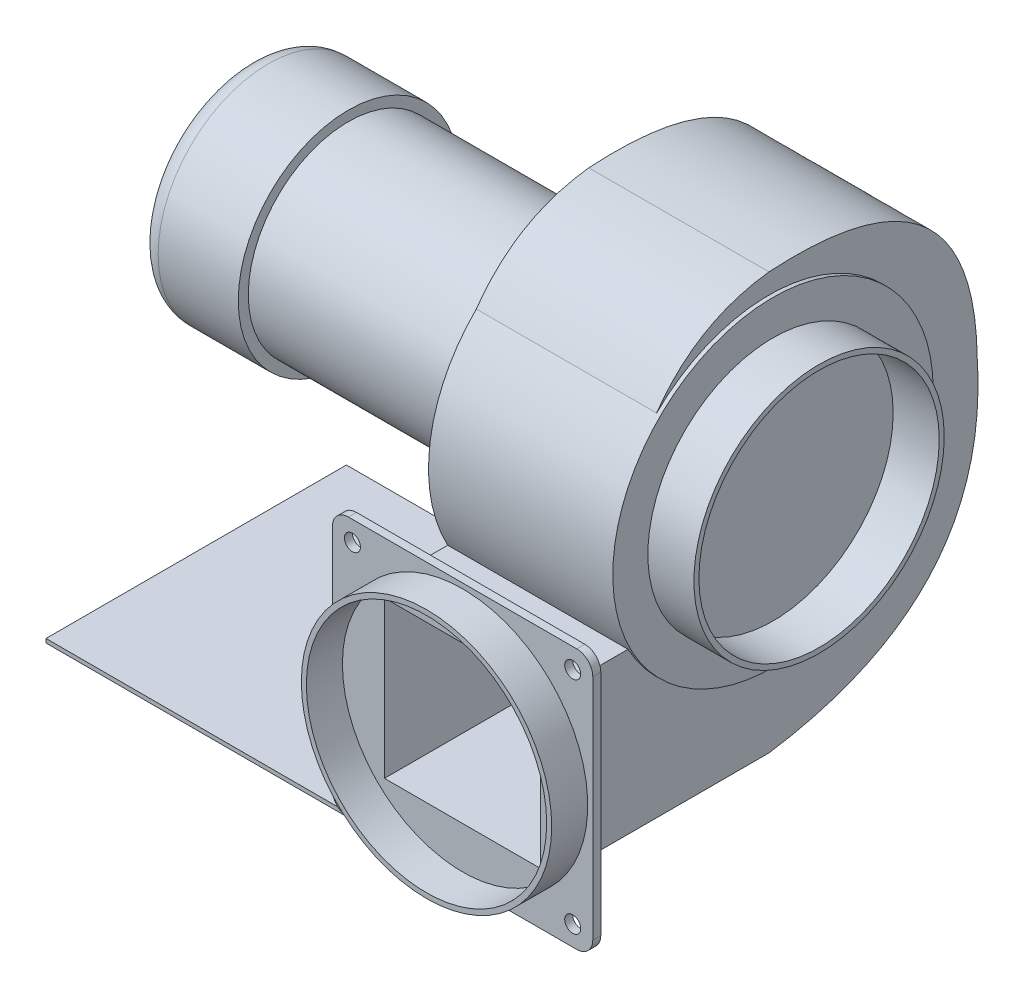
ISO-10303-21;
HEADER;
FILE_DESCRIPTION(('STEP AP214'),'2;1');
FILE_NAME('part.step','',(''),(''),'','','');
FILE_SCHEMA(('AUTOMOTIVE_DESIGN { 1 0 10303 214 1 1 1 1 }'));
ENDSEC;
DATA;
#1=APPLICATION_CONTEXT('core data for automotive mechanical design processes');
#2=APPLICATION_PROTOCOL_DEFINITION('international standard','automotive_design',2000,#1);
#3=PRODUCT_CONTEXT('',#1,'mechanical');
#4=PRODUCT('Part','Part','',(#3));
#5=PRODUCT_RELATED_PRODUCT_CATEGORY('part','',(#4));
#6=PRODUCT_DEFINITION_FORMATION('','',#4);
#7=PRODUCT_DEFINITION_CONTEXT('part definition',#1,'design');
#8=PRODUCT_DEFINITION('design','',#6,#7);
#9=PRODUCT_DEFINITION_SHAPE('','',#8);
#10=(LENGTH_UNIT() NAMED_UNIT(*) SI_UNIT(.MILLI.,.METRE.));
#11=(NAMED_UNIT(*) PLANE_ANGLE_UNIT() SI_UNIT($,.RADIAN.));
#12=(NAMED_UNIT(*) SI_UNIT($,.STERADIAN.) SOLID_ANGLE_UNIT());
#13=UNCERTAINTY_MEASURE_WITH_UNIT(LENGTH_MEASURE(1.E-05),#10,'distance_accuracy_value','');
#14=(GEOMETRIC_REPRESENTATION_CONTEXT(3) GLOBAL_UNCERTAINTY_ASSIGNED_CONTEXT((#13)) GLOBAL_UNIT_ASSIGNED_CONTEXT((#10,
#11,#12)) REPRESENTATION_CONTEXT('',''));
#15=CARTESIAN_POINT('',(0.,0.,0.));
#16=DIRECTION('',(0.,0.,1.));
#17=DIRECTION('',(1.,0.,0.));
#18=AXIS2_PLACEMENT_3D('',#15,#16,#17);
#19=CARTESIAN_POINT('',(-2.,0.,0.));
#20=DIRECTION('',(1.,0.,0.));
#21=DIRECTION('',(0.,0.,-1.));
#22=AXIS2_PLACEMENT_3D('',#19,#20,#21);
#23=PLANE('',#22);
#24=DIRECTION('',(0.,0.,-1.));
#25=VECTOR('',#24,1.);
#26=CARTESIAN_POINT('',(-2.,-145.,-46.));
#27=LINE('',#26,#25);
#28=CARTESIAN_POINT('',(-2.,-145.,104.));
#29=VERTEX_POINT('',#28);
#30=CARTESIAN_POINT('',(-2.,-145.,-46.));
#31=VERTEX_POINT('',#30);
#32=EDGE_CURVE('E49',#29,#31,#27,.T.);
#33=ORIENTED_EDGE('',*,*,#32,.F.);
#34=DIRECTION('',(0.,1.,0.));
#35=VECTOR('',#34,1.);
#36=CARTESIAN_POINT('',(-2.,-147.,104.));
#37=LINE('',#36,#35);
#38=CARTESIAN_POINT('',(-2.,-143.,104.));
#39=VERTEX_POINT('',#38);
#40=EDGE_CURVE('E253',#29,#39,#37,.T.);
#41=ORIENTED_EDGE('',*,*,#40,.T.);
#42=CARTESIAN_POINT('',(-2.,-67.,104.));
#43=VERTEX_POINT('',#42);
#44=EDGE_CURVE('E252',#39,#43,#37,.T.);
#45=ORIENTED_EDGE('',*,*,#44,.T.);
#46=DIRECTION('',(0.,0.,-1.));
#47=VECTOR('',#46,1.);
#48=CARTESIAN_POINT('',(-2.,-67.,104.));
#49=LINE('',#48,#47);
#50=CARTESIAN_POINT('',(-2.,-67.,-46.));
#51=VERTEX_POINT('',#50);
#52=EDGE_CURVE('E247',#43,#51,#49,.T.);
#53=ORIENTED_EDGE('',*,*,#52,.T.);
#54=DIRECTION('',(0.,-1.,0.));
#55=VECTOR('',#54,1.);
#56=CARTESIAN_POINT('',(-2.,-147.,-46.));
#57=LINE('',#56,#55);
#58=EDGE_CURVE('E250',#51,#31,#57,.T.);
#59=ORIENTED_EDGE('',*,*,#58,.T.);
#60=EDGE_LOOP('',(#33,#41,#45,#53,#59));
#61=FACE_BOUND('',#60,.T.);
#62=ADVANCED_FACE('F34',(#61),#23,.F.);
#63=CARTESIAN_POINT('',(0.,79.570920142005,32.1623547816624));
#64=DIRECTION('',(-1.,0.,0.));
#65=DIRECTION('',(0.,0.,1.));
#66=AXIS2_PLACEMENT_3D('',#63,#64,#65);
#67=PLANE('',#66);
#68=CARTESIAN_POINT('',(0.,0.,0.));
#69=DIRECTION('',(-1.,0.,0.));
#70=DIRECTION('',(0.,0.,1.));
#71=AXIS2_PLACEMENT_3D('',#68,#69,#70);
#72=CIRCLE('',#71,50.);
#73=CARTESIAN_POINT('',(0.,0.,50.));
#74=VERTEX_POINT('',#73);
#75=EDGE_CURVE('E270',#74,#74,#72,.T.);
#76=ORIENTED_EDGE('',*,*,#75,.F.);
#77=EDGE_LOOP('',(#76));
#78=FACE_BOUND('',#77,.T.);
#79=DIRECTION('',(0.,-1.,0.));
#80=VECTOR('',#79,1.);
#81=CARTESIAN_POINT('',(0.,-147.,-46.));
#82=LINE('',#81,#80);
#83=CARTESIAN_POINT('',(0.,-67.,-46.));
#84=VERTEX_POINT('',#83);
#85=CARTESIAN_POINT('',(0.,-105.381645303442,-46.));
#86=VERTEX_POINT('',#85);
#87=EDGE_CURVE('E258',#84,#86,#82,.T.);
#88=ORIENTED_EDGE('',*,*,#87,.F.);
#89=DIRECTION('',(0.,0.,-1.));
#90=VECTOR('',#89,1.);
#91=CARTESIAN_POINT('',(0.,-67.,104.));
#92=LINE('',#91,#90);
#93=CARTESIAN_POINT('',(0.,-67.,104.));
#94=VERTEX_POINT('',#93);
#95=EDGE_CURVE('E246',#94,#84,#92,.T.);
#96=ORIENTED_EDGE('',*,*,#95,.F.);
#97=DIRECTION('',(0.,-1.,0.));
#98=VECTOR('',#97,1.);
#99=CARTESIAN_POINT('',(0.,-118.,104.));
#100=LINE('',#99,#98);
#101=CARTESIAN_POINT('',(0.,-38.,104.));
#102=VERTEX_POINT('',#101);
#103=EDGE_CURVE('E480',#102,#94,#100,.T.);
#104=ORIENTED_EDGE('',*,*,#103,.F.);
#105=DIRECTION('',(0.,0.,1.));
#106=VECTOR('',#105,1.);
#107=CARTESIAN_POINT('',(0.,-38.,104.));
#108=LINE('',#107,#106);
#109=CARTESIAN_POINT('',(0.,-38.,70.3988636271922));
#110=VERTEX_POINT('',#109);
#111=EDGE_CURVE('E478',#110,#102,#108,.T.);
#112=ORIENTED_EDGE('',*,*,#111,.F.);
#113=CARTESIAN_POINT('',(0.,0.,0.));
#114=DIRECTION('',(1.,0.,0.));
#115=DIRECTION('',(0.,0.,-1.));
#116=AXIS2_PLACEMENT_3D('',#113,#114,#115);
#117=CIRCLE('',#116,80.);
#118=CARTESIAN_POINT('',(0.,57.,56.1337688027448));
#119=VERTEX_POINT('',#118);
#120=EDGE_CURVE('E473',#119,#110,#117,.T.);
#121=ORIENTED_EDGE('',*,*,#120,.F.);
#122=CARTESIAN_POINT('',(0.,90.,0.));
#123=CARTESIAN_POINT('',(0.,85.6418402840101,36.2578251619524));
#124=CARTESIAN_POINT('',(0.,57.,56.1337688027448));
#125=B_SPLINE_CURVE_WITH_KNOTS('',2,(#122,#123,#124),.UNSPECIFIED.,.F.,.F.,(3,3),(0.,1.),.UNSPECIFIED.);
#126=CARTESIAN_POINT('',(0.,90.,0.));
#127=VERTEX_POINT('',#126);
#128=EDGE_CURVE('E414',#127,#119,#125,.T.);
#129=ORIENTED_EDGE('',*,*,#128,.F.);
#130=CARTESIAN_POINT('',(0.,0.,-104.));
#131=CARTESIAN_POINT('',(0.,96.6691646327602,-102.835326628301));
#132=CARTESIAN_POINT('',(0.,90.,0.));
#133=B_SPLINE_CURVE_WITH_KNOTS('',2,(#130,#131,#132),.UNSPECIFIED.,.F.,.F.,(3,3),(0.,1.),.UNSPECIFIED.);
#134=CARTESIAN_POINT('',(0.,0.,-104.));
#135=VERTEX_POINT('',#134);
#136=EDGE_CURVE('E421',#135,#127,#133,.T.);
#137=ORIENTED_EDGE('',*,*,#136,.F.);
#138=CARTESIAN_POINT('',(0.,-118.,0.));
#139=CARTESIAN_POINT('',(0.,-101.631271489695,-110.598151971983));
#140=CARTESIAN_POINT('',(0.,0.,-104.));
#141=B_SPLINE_CURVE_WITH_KNOTS('',2,(#138,#139,#140),.UNSPECIFIED.,.F.,.F.,(3,3),(0.,1.),.UNSPECIFIED.);
#142=EDGE_CURVE('E486',#86,#135,#141,.T.);
#143=ORIENTED_EDGE('',*,*,#142,.F.);
#144=EDGE_LOOP('',(#88,#96,#104,#112,#121,#129,#137,#143));
#145=FACE_BOUND('',#144,.T.);
#146=ADVANCED_FACE('F548',(#78,#145),#67,.T.);
#147=CARTESIAN_POINT('',(102.,-21.,104.));
#148=DIRECTION('',(0.,0.,-1.));
#149=DIRECTION('',(-1.,0.,0.));
#150=AXIS2_PLACEMENT_3D('',#147,#148,#149);
#151=PLANE('',#150);
#152=CARTESIAN_POINT('',(-9.99999999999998,-23.,104.));
#153=DIRECTION('',(0.,0.,1.));
#154=DIRECTION('',(1.,0.,0.));
#155=AXIS2_PLACEMENT_3D('',#152,#153,#154);
#156=CIRCLE('',#155,4.);
#157=CARTESIAN_POINT('',(-5.99999999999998,-23.,104.));
#158=VERTEX_POINT('',#157);
#159=EDGE_CURVE('E339',#158,#158,#156,.T.);
#160=ORIENTED_EDGE('',*,*,#159,.T.);
#161=EDGE_LOOP('',(#160));
#162=FACE_BOUND('',#161,.T.);
#163=CARTESIAN_POINT('',(100.,-23.,104.));
#164=DIRECTION('',(0.,0.,1.));
#165=DIRECTION('',(1.,0.,0.));
#166=AXIS2_PLACEMENT_3D('',#163,#164,#165);
#167=CIRCLE('',#166,4.00000000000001);
#168=CARTESIAN_POINT('',(104.,-23.,104.));
#169=VERTEX_POINT('',#168);
#170=EDGE_CURVE('E333',#169,#169,#167,.T.);
#171=ORIENTED_EDGE('',*,*,#170,.T.);
#172=EDGE_LOOP('',(#171));
#173=FACE_BOUND('',#172,.T.);
#174=CARTESIAN_POINT('',(100.,-133.,104.));
#175=DIRECTION('',(0.,0.,1.));
#176=DIRECTION('',(1.,0.,0.));
#177=AXIS2_PLACEMENT_3D('',#174,#175,#176);
#178=CIRCLE('',#177,4.00000000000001);
#179=CARTESIAN_POINT('',(104.,-133.,104.));
#180=VERTEX_POINT('',#179);
#181=EDGE_CURVE('E327',#180,#180,#178,.T.);
#182=ORIENTED_EDGE('',*,*,#181,.T.);
#183=EDGE_LOOP('',(#182));
#184=FACE_BOUND('',#183,.T.);
#185=CARTESIAN_POINT('',(-9.99999999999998,-133.,104.));
#186=DIRECTION('',(0.,0.,1.));
#187=DIRECTION('',(1.,0.,0.));
#188=AXIS2_PLACEMENT_3D('',#185,#186,#187);
#189=CIRCLE('',#188,4.);
#190=CARTESIAN_POINT('',(-5.99999999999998,-133.,104.));
#191=VERTEX_POINT('',#190);
#192=EDGE_CURVE('E321',#191,#191,#189,.T.);
#193=ORIENTED_EDGE('',*,*,#192,.T.);
#194=EDGE_LOOP('',(#193));
#195=FACE_BOUND('',#194,.T.);
#196=ORIENTED_EDGE('',*,*,#103,.T.);
#197=DIRECTION('',(1.,0.,0.));
#198=VECTOR('',#197,1.);
#199=CARTESIAN_POINT('',(-2.,-67.,104.));
#200=LINE('',#199,#198);
#201=EDGE_CURVE('E255',#43,#94,#200,.T.);
#202=ORIENTED_EDGE('',*,*,#201,.F.);
#203=ORIENTED_EDGE('',*,*,#44,.F.);
#204=DIRECTION('',(1.,0.,0.));
#205=VECTOR('',#204,1.);
#206=CARTESIAN_POINT('',(-11.9999999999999,-143.,104.));
#207=LINE('',#206,#205);
#208=CARTESIAN_POINT('',(-11.9999999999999,-143.,104.));
#209=VERTEX_POINT('',#208);
#210=EDGE_CURVE('E384',#209,#39,#207,.T.);
#211=ORIENTED_EDGE('',*,*,#210,.F.);
#212=CARTESIAN_POINT('',(-12.,-135.,104.));
#213=DIRECTION('',(0.,0.,1.));
#214=DIRECTION('',(-1.,0.,0.));
#215=AXIS2_PLACEMENT_3D('',#212,#213,#214);
#216=CIRCLE('',#215,8.);
#217=CARTESIAN_POINT('',(-20.,-135.,104.));
#218=VERTEX_POINT('',#217);
#219=EDGE_CURVE('E381',#218,#209,#216,.T.);
#220=ORIENTED_EDGE('',*,*,#219,.F.);
#221=DIRECTION('',(0.,-1.,0.));
#222=VECTOR('',#221,1.);
#223=CARTESIAN_POINT('',(-20.,-135.,104.));
#224=LINE('',#223,#222);
#225=CARTESIAN_POINT('',(-20.,-21.0000000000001,104.));
#226=VERTEX_POINT('',#225);
#227=EDGE_CURVE('E379',#226,#218,#224,.T.);
#228=ORIENTED_EDGE('',*,*,#227,.F.);
#229=CARTESIAN_POINT('',(-12.,-21.,104.));
#230=DIRECTION('',(0.,0.,1.));
#231=DIRECTION('',(-1.,0.,0.));
#232=AXIS2_PLACEMENT_3D('',#229,#230,#231);
#233=CIRCLE('',#232,8.);
#234=CARTESIAN_POINT('',(-11.9999999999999,-13.,104.));
#235=VERTEX_POINT('',#234);
#236=EDGE_CURVE('E377',#235,#226,#233,.T.);
#237=ORIENTED_EDGE('',*,*,#236,.F.);
#238=DIRECTION('',(-1.,0.,0.));
#239=VECTOR('',#238,1.);
#240=CARTESIAN_POINT('',(-11.9999999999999,-13.,104.));
#241=LINE('',#240,#239);
#242=CARTESIAN_POINT('',(102.,-13.,104.));
#243=VERTEX_POINT('',#242);
#244=EDGE_CURVE('E375',#243,#235,#241,.T.);
#245=ORIENTED_EDGE('',*,*,#244,.F.);
#246=CARTESIAN_POINT('',(102.,-21.,104.));
#247=DIRECTION('',(0.,0.,1.));
#248=DIRECTION('',(-1.,0.,0.));
#249=AXIS2_PLACEMENT_3D('',#246,#247,#248);
#250=CIRCLE('',#249,8.);
#251=CARTESIAN_POINT('',(110.,-21.0000000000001,104.));
#252=VERTEX_POINT('',#251);
#253=EDGE_CURVE('E353',#252,#243,#250,.T.);
#254=ORIENTED_EDGE('',*,*,#253,.F.);
#255=DIRECTION('',(0.,1.,0.));
#256=VECTOR('',#255,1.);
#257=CARTESIAN_POINT('',(110.,-135.,104.));
#258=LINE('',#257,#256);
#259=CARTESIAN_POINT('',(110.,-135.,104.));
#260=VERTEX_POINT('',#259);
#261=EDGE_CURVE('E358',#260,#252,#258,.T.);
#262=ORIENTED_EDGE('',*,*,#261,.F.);
#263=CARTESIAN_POINT('',(102.,-135.,104.));
#264=DIRECTION('',(0.,0.,1.));
#265=DIRECTION('',(1.,0.,0.));
#266=AXIS2_PLACEMENT_3D('',#263,#264,#265);
#267=CIRCLE('',#266,8.);
#268=CARTESIAN_POINT('',(102.,-143.,104.));
#269=VERTEX_POINT('',#268);
#270=EDGE_CURVE('E387',#269,#260,#267,.T.);
#271=ORIENTED_EDGE('',*,*,#270,.F.);
#272=CARTESIAN_POINT('',(0.,-143.,104.));
#273=VERTEX_POINT('',#272);
#274=EDGE_CURVE('E383',#273,#269,#207,.T.);
#275=ORIENTED_EDGE('',*,*,#274,.F.);
#276=DIRECTION('',(0.,1.,0.));
#277=VECTOR('',#276,1.);
#278=CARTESIAN_POINT('',(0.,-147.,104.));
#279=LINE('',#278,#277);
#280=CARTESIAN_POINT('',(0.,-118.,104.));
#281=VERTEX_POINT('',#280);
#282=EDGE_CURVE('E262',#273,#281,#279,.T.);
#283=ORIENTED_EDGE('',*,*,#282,.T.);
#284=DIRECTION('',(-1.,0.,0.));
#285=VECTOR('',#284,1.);
#286=CARTESIAN_POINT('',(90.,-118.,104.));
#287=LINE('',#286,#285);
#288=CARTESIAN_POINT('',(90.,-118.,104.));
#289=VERTEX_POINT('',#288);
#290=EDGE_CURVE('E509',#289,#281,#287,.T.);
#291=ORIENTED_EDGE('',*,*,#290,.F.);
#292=DIRECTION('',(0.,-1.,0.));
#293=VECTOR('',#292,1.);
#294=CARTESIAN_POINT('',(90.,-118.,104.));
#295=LINE('',#294,#293);
#296=CARTESIAN_POINT('',(90.,-38.,104.));
#297=VERTEX_POINT('',#296);
#298=EDGE_CURVE('E709',#297,#289,#295,.T.);
#299=ORIENTED_EDGE('',*,*,#298,.F.);
#300=DIRECTION('',(-1.,0.,0.));
#301=VECTOR('',#300,1.);
#302=CARTESIAN_POINT('',(90.,-38.,104.));
#303=LINE('',#302,#301);
#304=EDGE_CURVE('E512',#297,#102,#303,.T.);
#305=ORIENTED_EDGE('',*,*,#304,.T.);
#306=EDGE_LOOP('',(#196,#202,#203,#211,#220,#228,#237,#245,#254,#262,#271,#275,#283,#291,#299,#305));
#307=FACE_BOUND('',#306,.T.);
#308=ADVANCED_FACE('F553',(#162,#173,#184,#195,#307),#151,.T.);
#309=CARTESIAN_POINT('',(92.,0.,0.));
#310=DIRECTION('',(1.,0.,0.));
#311=DIRECTION('',(0.,0.,-1.));
#312=AXIS2_PLACEMENT_3D('',#309,#310,#311);
#313=PLANE('',#312);
#314=CARTESIAN_POINT('',(92.,0.,0.));
#315=DIRECTION('',(1.,0.,0.));
#316=DIRECTION('',(0.,0.,-1.));
#317=AXIS2_PLACEMENT_3D('',#314,#315,#316);
#318=CIRCLE('',#317,80.);
#319=CARTESIAN_POINT('',(92.,0.,-80.));
#320=VERTEX_POINT('',#319);
#321=EDGE_CURVE('E315',#320,#320,#318,.T.);
#322=ORIENTED_EDGE('',*,*,#321,.T.);
#323=EDGE_LOOP('',(#322));
#324=FACE_BOUND('',#323,.T.);
#325=CARTESIAN_POINT('',(92.,0.,0.));
#326=DIRECTION('',(1.,0.,0.));
#327=DIRECTION('',(0.,0.,-1.));
#328=AXIS2_PLACEMENT_3D('',#325,#326,#327);
#329=CIRCLE('',#328,62.5);
#330=CARTESIAN_POINT('',(92.,0.,-62.5));
#331=VERTEX_POINT('',#330);
#332=EDGE_CURVE('E311',#331,#331,#329,.T.);
#333=ORIENTED_EDGE('',*,*,#332,.F.);
#334=EDGE_LOOP('',(#333));
#335=FACE_BOUND('',#334,.T.);
#336=ADVANCED_FACE('F617',(#324,#335),#313,.T.);
#337=CARTESIAN_POINT('',(90.,79.570920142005,32.1623547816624));
#338=DIRECTION('',(-1.,0.,0.));
#339=DIRECTION('',(0.,0.,1.));
#340=AXIS2_PLACEMENT_3D('',#337,#338,#339);
#341=PLANE('',#340);
#342=CARTESIAN_POINT('',(90.,0.,0.));
#343=DIRECTION('',(-1.,0.,0.));
#344=DIRECTION('',(0.,0.,1.));
#345=AXIS2_PLACEMENT_3D('',#342,#343,#344);
#346=CIRCLE('',#345,80.);
#347=CARTESIAN_POINT('',(90.,-38.,70.3988636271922));
#348=VERTEX_POINT('',#347);
#349=CARTESIAN_POINT('',(90.,57.,56.1337688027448));
#350=VERTEX_POINT('',#349);
#351=EDGE_CURVE('E524',#348,#350,#346,.F.);
#352=ORIENTED_EDGE('',*,*,#351,.F.);
#353=DIRECTION('',(0.,0.,1.));
#354=VECTOR('',#353,1.);
#355=CARTESIAN_POINT('',(90.,-38.,104.));
#356=LINE('',#355,#354);
#357=EDGE_CURVE('E420',#348,#297,#356,.T.);
#358=ORIENTED_EDGE('',*,*,#357,.T.);
#359=ORIENTED_EDGE('',*,*,#298,.T.);
#360=DIRECTION('',(0.,0.,-1.));
#361=VECTOR('',#360,1.);
#362=CARTESIAN_POINT('',(90.,-118.,0.));
#363=LINE('',#362,#361);
#364=CARTESIAN_POINT('',(90.,-118.,0.));
#365=VERTEX_POINT('',#364);
#366=EDGE_CURVE('E457',#289,#365,#363,.T.);
#367=ORIENTED_EDGE('',*,*,#366,.T.);
#368=CARTESIAN_POINT('',(90.,-118.,0.));
#369=CARTESIAN_POINT('',(90.,-101.631271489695,-110.598151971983));
#370=CARTESIAN_POINT('',(90.,0.,-104.));
#371=B_SPLINE_CURVE_WITH_KNOTS('',2,(#368,#369,#370),.UNSPECIFIED.,.F.,.F.,(3,3),(0.,1.),.UNSPECIFIED.);
#372=CARTESIAN_POINT('',(90.,0.,-104.));
#373=VERTEX_POINT('',#372);
#374=EDGE_CURVE('E451',#365,#373,#371,.T.);
#375=ORIENTED_EDGE('',*,*,#374,.T.);
#376=CARTESIAN_POINT('',(90.,0.,-104.));
#377=CARTESIAN_POINT('',(90.,96.6691646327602,-102.835326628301));
#378=CARTESIAN_POINT('',(90.,90.,0.));
#379=B_SPLINE_CURVE_WITH_KNOTS('',2,(#376,#377,#378),.UNSPECIFIED.,.F.,.F.,(3,3),(0.,1.),.UNSPECIFIED.);
#380=CARTESIAN_POINT('',(90.,90.,0.));
#381=VERTEX_POINT('',#380);
#382=EDGE_CURVE('E456',#373,#381,#379,.T.);
#383=ORIENTED_EDGE('',*,*,#382,.T.);
#384=CARTESIAN_POINT('',(90.,90.,0.));
#385=CARTESIAN_POINT('',(90.,85.6418402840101,36.2578251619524));
#386=CARTESIAN_POINT('',(90.,57.,56.1337688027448));
#387=B_SPLINE_CURVE_WITH_KNOTS('',2,(#384,#385,#386),.UNSPECIFIED.,.F.,.F.,(3,3),(0.,1.),.UNSPECIFIED.);
#388=EDGE_CURVE('E415',#381,#350,#387,.T.);
#389=ORIENTED_EDGE('',*,*,#388,.T.);
#390=EDGE_LOOP('',(#352,#358,#359,#367,#375,#383,#389));
#391=FACE_BOUND('',#390,.T.);
#392=ADVANCED_FACE('F684',(#391),#341,.F.);
#393=CARTESIAN_POINT('',(102.,-21.,108.));
#394=DIRECTION('',(0.,0.,-1.));
#395=DIRECTION('',(-1.,0.,0.));
#396=AXIS2_PLACEMENT_3D('',#393,#394,#395);
#397=PLANE('',#396);
#398=CARTESIAN_POINT('',(-9.99999999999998,-133.,108.));
#399=DIRECTION('',(0.,0.,1.));
#400=DIRECTION('',(1.,0.,0.));
#401=AXIS2_PLACEMENT_3D('',#398,#399,#400);
#402=CIRCLE('',#401,4.);
#403=CARTESIAN_POINT('',(-5.99999999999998,-133.,108.));
#404=VERTEX_POINT('',#403);
#405=EDGE_CURVE('E320',#404,#404,#402,.T.);
#406=ORIENTED_EDGE('',*,*,#405,.F.);
#407=EDGE_LOOP('',(#406));
#408=FACE_BOUND('',#407,.T.);
#409=CARTESIAN_POINT('',(100.,-133.,108.));
#410=DIRECTION('',(0.,0.,1.));
#411=DIRECTION('',(1.,0.,0.));
#412=AXIS2_PLACEMENT_3D('',#409,#410,#411);
#413=CIRCLE('',#412,4.00000000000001);
#414=CARTESIAN_POINT('',(104.,-133.,108.));
#415=VERTEX_POINT('',#414);
#416=EDGE_CURVE('E324',#415,#415,#413,.T.);
#417=ORIENTED_EDGE('',*,*,#416,.F.);
#418=EDGE_LOOP('',(#417));
#419=FACE_BOUND('',#418,.T.);
#420=CARTESIAN_POINT('',(100.,-23.,108.));
#421=DIRECTION('',(0.,0.,1.));
#422=DIRECTION('',(1.,0.,0.));
#423=AXIS2_PLACEMENT_3D('',#420,#421,#422);
#424=CIRCLE('',#423,4.00000000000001);
#425=CARTESIAN_POINT('',(104.,-23.,108.));
#426=VERTEX_POINT('',#425);
#427=EDGE_CURVE('E330',#426,#426,#424,.T.);
#428=ORIENTED_EDGE('',*,*,#427,.F.);
#429=EDGE_LOOP('',(#428));
#430=FACE_BOUND('',#429,.T.);
#431=CARTESIAN_POINT('',(-9.99999999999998,-23.,108.));
#432=DIRECTION('',(0.,0.,1.));
#433=DIRECTION('',(1.,0.,0.));
#434=AXIS2_PLACEMENT_3D('',#431,#432,#433);
#435=CIRCLE('',#434,4.);
#436=CARTESIAN_POINT('',(-5.99999999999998,-23.,108.));
#437=VERTEX_POINT('',#436);
#438=EDGE_CURVE('E336',#437,#437,#435,.T.);
#439=ORIENTED_EDGE('',*,*,#438,.F.);
#440=EDGE_LOOP('',(#439));
#441=FACE_BOUND('',#440,.T.);
#442=CARTESIAN_POINT('',(102.,-21.,108.));
#443=DIRECTION('',(0.,0.,1.));
#444=DIRECTION('',(-1.,0.,0.));
#445=AXIS2_PLACEMENT_3D('',#442,#443,#444);
#446=CIRCLE('',#445,8.);
#447=CARTESIAN_POINT('',(110.,-21.0000000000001,108.));
#448=VERTEX_POINT('',#447);
#449=CARTESIAN_POINT('',(102.,-13.,108.));
#450=VERTEX_POINT('',#449);
#451=EDGE_CURVE('E354',#448,#450,#446,.T.);
#452=ORIENTED_EDGE('',*,*,#451,.T.);
#453=DIRECTION('',(-1.,0.,0.));
#454=VECTOR('',#453,1.);
#455=CARTESIAN_POINT('',(-11.9999999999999,-13.,108.));
#456=LINE('',#455,#454);
#457=CARTESIAN_POINT('',(-11.9999999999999,-13.,108.));
#458=VERTEX_POINT('',#457);
#459=EDGE_CURVE('E357',#450,#458,#456,.T.);
#460=ORIENTED_EDGE('',*,*,#459,.T.);
#461=CARTESIAN_POINT('',(-12.,-21.,108.));
#462=DIRECTION('',(0.,0.,1.));
#463=DIRECTION('',(-1.,0.,0.));
#464=AXIS2_PLACEMENT_3D('',#461,#462,#463);
#465=CIRCLE('',#464,8.);
#466=CARTESIAN_POINT('',(-20.,-21.0000000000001,108.));
#467=VERTEX_POINT('',#466);
#468=EDGE_CURVE('E360',#458,#467,#465,.T.);
#469=ORIENTED_EDGE('',*,*,#468,.T.);
#470=DIRECTION('',(0.,-1.,0.));
#471=VECTOR('',#470,1.);
#472=CARTESIAN_POINT('',(-20.,-135.,108.));
#473=LINE('',#472,#471);
#474=CARTESIAN_POINT('',(-20.,-135.,108.));
#475=VERTEX_POINT('',#474);
#476=EDGE_CURVE('E362',#467,#475,#473,.T.);
#477=ORIENTED_EDGE('',*,*,#476,.T.);
#478=CARTESIAN_POINT('',(-12.,-135.,108.));
#479=DIRECTION('',(0.,0.,1.));
#480=DIRECTION('',(-1.,0.,0.));
#481=AXIS2_PLACEMENT_3D('',#478,#479,#480);
#482=CIRCLE('',#481,8.);
#483=CARTESIAN_POINT('',(-11.9999999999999,-143.,108.));
#484=VERTEX_POINT('',#483);
#485=EDGE_CURVE('E364',#475,#484,#482,.T.);
#486=ORIENTED_EDGE('',*,*,#485,.T.);
#487=DIRECTION('',(1.,0.,0.));
#488=VECTOR('',#487,1.);
#489=CARTESIAN_POINT('',(-11.9999999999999,-143.,108.));
#490=LINE('',#489,#488);
#491=CARTESIAN_POINT('',(102.,-143.,108.));
#492=VERTEX_POINT('',#491);
#493=EDGE_CURVE('E366',#484,#492,#490,.T.);
#494=ORIENTED_EDGE('',*,*,#493,.T.);
#495=CARTESIAN_POINT('',(102.,-135.,108.));
#496=DIRECTION('',(0.,0.,1.));
#497=DIRECTION('',(1.,0.,0.));
#498=AXIS2_PLACEMENT_3D('',#495,#496,#497);
#499=CIRCLE('',#498,8.);
#500=CARTESIAN_POINT('',(110.,-135.,108.));
#501=VERTEX_POINT('',#500);
#502=EDGE_CURVE('E368',#492,#501,#499,.T.);
#503=ORIENTED_EDGE('',*,*,#502,.T.);
#504=DIRECTION('',(0.,1.,0.));
#505=VECTOR('',#504,1.);
#506=CARTESIAN_POINT('',(110.,-135.,108.));
#507=LINE('',#506,#505);
#508=EDGE_CURVE('E370',#501,#448,#507,.T.);
#509=ORIENTED_EDGE('',*,*,#508,.T.);
#510=EDGE_LOOP('',(#452,#460,#469,#477,#486,#494,#503,#509));
#511=FACE_BOUND('',#510,.T.);
#512=CARTESIAN_POINT('',(45.,-78.,108.));
#513=DIRECTION('',(0.,0.,-1.));
#514=DIRECTION('',(-1.,0.,0.));
#515=AXIS2_PLACEMENT_3D('',#512,#513,#514);
#516=CIRCLE('',#515,62.5);
#517=CARTESIAN_POINT('',(-17.5,-78.,108.));
#518=VERTEX_POINT('',#517);
#519=EDGE_CURVE('E521',#518,#518,#516,.F.);
#520=ORIENTED_EDGE('',*,*,#519,.F.);
#521=EDGE_LOOP('',(#520));
#522=FACE_BOUND('',#521,.T.);
#523=ADVANCED_FACE('F430',(#408,#419,#430,#441,#511,#522),#397,.F.);
#524=DIRECTION('',(-1.,0.,0.));
#525=VECTOR('',#524,1.);
#526=SURFACE_OF_LINEAR_EXTRUSION('',#387,#525);
#527=ORIENTED_EDGE('',*,*,#128,.T.);
#528=DIRECTION('',(-1.,0.,0.));
#529=VECTOR('',#528,1.);
#530=CARTESIAN_POINT('',(90.,57.,56.1337688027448));
#531=LINE('',#530,#529);
#532=EDGE_CURVE('E518',#350,#119,#531,.T.);
#533=ORIENTED_EDGE('',*,*,#532,.F.);
#534=ORIENTED_EDGE('',*,*,#388,.F.);
#535=DIRECTION('',(-1.,0.,0.));
#536=VECTOR('',#535,1.);
#537=CARTESIAN_POINT('',(90.,90.,0.));
#538=LINE('',#537,#536);
#539=EDGE_CURVE('E465',#381,#127,#538,.T.);
#540=ORIENTED_EDGE('',*,*,#539,.T.);
#541=EDGE_LOOP('',(#527,#533,#534,#540));
#542=FACE_BOUND('',#541,.T.);
#543=ADVANCED_FACE('F426',(#542),#526,.F.);
#544=CARTESIAN_POINT('',(90.,0.,0.));
#545=DIRECTION('',(-1.,0.,0.));
#546=DIRECTION('',(0.,0.,1.));
#547=AXIS2_PLACEMENT_3D('',#544,#545,#546);
#548=CYLINDRICAL_SURFACE('',#547,80.);
#549=ORIENTED_EDGE('',*,*,#120,.T.);
#550=DIRECTION('',(-1.,0.,0.));
#551=VECTOR('',#550,1.);
#552=CARTESIAN_POINT('',(90.,-38.,70.3988636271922));
#553=LINE('',#552,#551);
#554=EDGE_CURVE('E515',#348,#110,#553,.T.);
#555=ORIENTED_EDGE('',*,*,#554,.F.);
#556=ORIENTED_EDGE('',*,*,#351,.T.);
#557=ORIENTED_EDGE('',*,*,#532,.T.);
#558=EDGE_LOOP('',(#549,#555,#556,#557));
#559=FACE_BOUND('',#558,.T.);
#560=ORIENTED_EDGE('',*,*,#321,.F.);
#561=EDGE_LOOP('',(#560));
#562=FACE_BOUND('',#561,.T.);
#563=ADVANCED_FACE('F429',(#559,#562),#548,.T.);
#564=CARTESIAN_POINT('',(90.,-38.,104.));
#565=DIRECTION('',(0.,-1.,0.));
#566=DIRECTION('',(0.,0.,-1.));
#567=AXIS2_PLACEMENT_3D('',#564,#565,#566);
#568=PLANE('',#567);
#569=ORIENTED_EDGE('',*,*,#111,.T.);
#570=ORIENTED_EDGE('',*,*,#304,.F.);
#571=ORIENTED_EDGE('',*,*,#357,.F.);
#572=ORIENTED_EDGE('',*,*,#554,.T.);
#573=EDGE_LOOP('',(#569,#570,#571,#572));
#574=FACE_BOUND('',#573,.T.);
#575=ADVANCED_FACE('F434',(#574),#568,.F.);
#576=CARTESIAN_POINT('',(90.,-118.,0.));
#577=DIRECTION('',(0.,1.,0.));
#578=DIRECTION('',(0.,0.,1.));
#579=AXIS2_PLACEMENT_3D('',#576,#577,#578);
#580=PLANE('',#579);
#581=DIRECTION('',(0.,0.,-1.));
#582=VECTOR('',#581,1.);
#583=CARTESIAN_POINT('',(0.,-118.,0.));
#584=LINE('',#583,#582);
#585=CARTESIAN_POINT('',(0.,-118.,0.));
#586=VERTEX_POINT('',#585);
#587=EDGE_CURVE('E483',#281,#586,#584,.T.);
#588=ORIENTED_EDGE('',*,*,#587,.T.);
#589=DIRECTION('',(-1.,0.,0.));
#590=VECTOR('',#589,1.);
#591=CARTESIAN_POINT('',(90.,-118.,0.));
#592=LINE('',#591,#590);
#593=EDGE_CURVE('E506',#365,#586,#592,.T.);
#594=ORIENTED_EDGE('',*,*,#593,.F.);
#595=ORIENTED_EDGE('',*,*,#366,.F.);
#596=ORIENTED_EDGE('',*,*,#290,.T.);
#597=EDGE_LOOP('',(#588,#594,#595,#596));
#598=FACE_BOUND('',#597,.T.);
#599=ADVANCED_FACE('F438',(#598),#580,.F.);
#600=DIRECTION('',(-1.,0.,0.));
#601=VECTOR('',#600,1.);
#602=SURFACE_OF_LINEAR_EXTRUSION('',#371,#601);
#603=EDGE_CURVE('E487',#586,#86,#141,.T.);
#604=ORIENTED_EDGE('',*,*,#603,.T.);
#605=ORIENTED_EDGE('',*,*,#142,.T.);
#606=DIRECTION('',(-1.,0.,0.));
#607=VECTOR('',#606,1.);
#608=CARTESIAN_POINT('',(90.,0.,-104.));
#609=LINE('',#608,#607);
#610=EDGE_CURVE('E503',#373,#135,#609,.T.);
#611=ORIENTED_EDGE('',*,*,#610,.F.);
#612=ORIENTED_EDGE('',*,*,#374,.F.);
#613=ORIENTED_EDGE('',*,*,#593,.T.);
#614=EDGE_LOOP('',(#604,#605,#611,#612,#613));
#615=FACE_BOUND('',#614,.T.);
#616=ADVANCED_FACE('F442',(#615),#602,.F.);
#617=DIRECTION('',(-1.,0.,0.));
#618=VECTOR('',#617,1.);
#619=SURFACE_OF_LINEAR_EXTRUSION('',#379,#618);
#620=ORIENTED_EDGE('',*,*,#136,.T.);
#621=ORIENTED_EDGE('',*,*,#539,.F.);
#622=ORIENTED_EDGE('',*,*,#382,.F.);
#623=ORIENTED_EDGE('',*,*,#610,.T.);
#624=EDGE_LOOP('',(#620,#621,#622,#623));
#625=FACE_BOUND('',#624,.T.);
#626=ADVANCED_FACE('F447',(#625),#619,.F.);
#627=CARTESIAN_POINT('',(102.,-21.,108.));
#628=DIRECTION('',(0.,0.,-1.));
#629=DIRECTION('',(-1.,0.,0.));
#630=AXIS2_PLACEMENT_3D('',#627,#628,#629);
#631=CYLINDRICAL_SURFACE('',#630,8.);
#632=ORIENTED_EDGE('',*,*,#253,.T.);
#633=DIRECTION('',(0.,0.,-1.));
#634=VECTOR('',#633,1.);
#635=CARTESIAN_POINT('',(102.,-13.,108.));
#636=LINE('',#635,#634);
#637=EDGE_CURVE('E411',#450,#243,#636,.T.);
#638=ORIENTED_EDGE('',*,*,#637,.F.);
#639=ORIENTED_EDGE('',*,*,#451,.F.);
#640=DIRECTION('',(0.,0.,-1.));
#641=VECTOR('',#640,1.);
#642=CARTESIAN_POINT('',(110.,-21.0000000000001,108.));
#643=LINE('',#642,#641);
#644=EDGE_CURVE('E372',#448,#252,#643,.T.);
#645=ORIENTED_EDGE('',*,*,#644,.T.);
#646=EDGE_LOOP('',(#632,#638,#639,#645));
#647=FACE_BOUND('',#646,.T.);
#648=ADVANCED_FACE('F679',(#647),#631,.T.);
#649=CARTESIAN_POINT('',(-11.9999999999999,-13.,108.));
#650=DIRECTION('',(0.,-1.,0.));
#651=DIRECTION('',(0.,0.,-1.));
#652=AXIS2_PLACEMENT_3D('',#649,#650,#651);
#653=PLANE('',#652);
#654=ORIENTED_EDGE('',*,*,#244,.T.);
#655=DIRECTION('',(0.,0.,-1.));
#656=VECTOR('',#655,1.);
#657=CARTESIAN_POINT('',(-11.9999999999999,-13.,108.));
#658=LINE('',#657,#656);
#659=EDGE_CURVE('E408',#458,#235,#658,.T.);
#660=ORIENTED_EDGE('',*,*,#659,.F.);
#661=ORIENTED_EDGE('',*,*,#459,.F.);
#662=ORIENTED_EDGE('',*,*,#637,.T.);
#663=EDGE_LOOP('',(#654,#660,#661,#662));
#664=FACE_BOUND('',#663,.T.);
#665=ADVANCED_FACE('F675',(#664),#653,.F.);
#666=CARTESIAN_POINT('',(-12.,-21.,108.));
#667=DIRECTION('',(0.,0.,-1.));
#668=DIRECTION('',(-1.,0.,0.));
#669=AXIS2_PLACEMENT_3D('',#666,#667,#668);
#670=CYLINDRICAL_SURFACE('',#669,8.);
#671=ORIENTED_EDGE('',*,*,#236,.T.);
#672=DIRECTION('',(0.,0.,-1.));
#673=VECTOR('',#672,1.);
#674=CARTESIAN_POINT('',(-20.,-21.0000000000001,108.));
#675=LINE('',#674,#673);
#676=EDGE_CURVE('E405',#467,#226,#675,.T.);
#677=ORIENTED_EDGE('',*,*,#676,.F.);
#678=ORIENTED_EDGE('',*,*,#468,.F.);
#679=ORIENTED_EDGE('',*,*,#659,.T.);
#680=EDGE_LOOP('',(#671,#677,#678,#679));
#681=FACE_BOUND('',#680,.T.);
#682=ADVANCED_FACE('F671',(#681),#670,.T.);
#683=CARTESIAN_POINT('',(-20.,-135.,108.));
#684=DIRECTION('',(1.,0.,0.));
#685=DIRECTION('',(0.,0.,-1.));
#686=AXIS2_PLACEMENT_3D('',#683,#684,#685);
#687=PLANE('',#686);
#688=ORIENTED_EDGE('',*,*,#227,.T.);
#689=DIRECTION('',(0.,0.,-1.));
#690=VECTOR('',#689,1.);
#691=CARTESIAN_POINT('',(-20.,-135.,108.));
#692=LINE('',#691,#690);
#693=EDGE_CURVE('E402',#475,#218,#692,.T.);
#694=ORIENTED_EDGE('',*,*,#693,.F.);
#695=ORIENTED_EDGE('',*,*,#476,.F.);
#696=ORIENTED_EDGE('',*,*,#676,.T.);
#697=EDGE_LOOP('',(#688,#694,#695,#696));
#698=FACE_BOUND('',#697,.T.);
#699=ADVANCED_FACE('F667',(#698),#687,.F.);
#700=CARTESIAN_POINT('',(-12.,-135.,108.));
#701=DIRECTION('',(0.,0.,-1.));
#702=DIRECTION('',(-1.,0.,0.));
#703=AXIS2_PLACEMENT_3D('',#700,#701,#702);
#704=CYLINDRICAL_SURFACE('',#703,8.);
#705=ORIENTED_EDGE('',*,*,#219,.T.);
#706=DIRECTION('',(0.,0.,-1.));
#707=VECTOR('',#706,1.);
#708=CARTESIAN_POINT('',(-11.9999999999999,-143.,108.));
#709=LINE('',#708,#707);
#710=EDGE_CURVE('E399',#484,#209,#709,.T.);
#711=ORIENTED_EDGE('',*,*,#710,.F.);
#712=ORIENTED_EDGE('',*,*,#485,.F.);
#713=ORIENTED_EDGE('',*,*,#693,.T.);
#714=EDGE_LOOP('',(#705,#711,#712,#713));
#715=FACE_BOUND('',#714,.T.);
#716=ADVANCED_FACE('F663',(#715),#704,.T.);
#717=CARTESIAN_POINT('',(-11.9999999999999,-143.,108.));
#718=DIRECTION('',(0.,1.,0.));
#719=DIRECTION('',(0.,0.,1.));
#720=AXIS2_PLACEMENT_3D('',#717,#718,#719);
#721=PLANE('',#720);
#722=ORIENTED_EDGE('',*,*,#210,.T.);
#723=EDGE_CURVE('E388',#39,#273,#207,.T.);
#724=ORIENTED_EDGE('',*,*,#723,.T.);
#725=ORIENTED_EDGE('',*,*,#274,.T.);
#726=DIRECTION('',(0.,0.,-1.));
#727=VECTOR('',#726,1.);
#728=CARTESIAN_POINT('',(102.,-143.,108.));
#729=LINE('',#728,#727);
#730=EDGE_CURVE('E396',#492,#269,#729,.T.);
#731=ORIENTED_EDGE('',*,*,#730,.F.);
#732=ORIENTED_EDGE('',*,*,#493,.F.);
#733=ORIENTED_EDGE('',*,*,#710,.T.);
#734=EDGE_LOOP('',(#722,#724,#725,#731,#732,#733));
#735=FACE_BOUND('',#734,.T.);
#736=ADVANCED_FACE('F659',(#735),#721,.F.);
#737=CARTESIAN_POINT('',(102.,-135.,108.));
#738=DIRECTION('',(0.,0.,-1.));
#739=DIRECTION('',(-1.,0.,0.));
#740=AXIS2_PLACEMENT_3D('',#737,#738,#739);
#741=CYLINDRICAL_SURFACE('',#740,8.);
#742=ORIENTED_EDGE('',*,*,#270,.T.);
#743=DIRECTION('',(0.,0.,-1.));
#744=VECTOR('',#743,1.);
#745=CARTESIAN_POINT('',(110.,-135.,108.));
#746=LINE('',#745,#744);
#747=EDGE_CURVE('E393',#501,#260,#746,.T.);
#748=ORIENTED_EDGE('',*,*,#747,.F.);
#749=ORIENTED_EDGE('',*,*,#502,.F.);
#750=ORIENTED_EDGE('',*,*,#730,.T.);
#751=EDGE_LOOP('',(#742,#748,#749,#750));
#752=FACE_BOUND('',#751,.T.);
#753=ADVANCED_FACE('F655',(#752),#741,.T.);
#754=CARTESIAN_POINT('',(110.,-135.,108.));
#755=DIRECTION('',(-1.,0.,0.));
#756=DIRECTION('',(0.,0.,1.));
#757=AXIS2_PLACEMENT_3D('',#754,#755,#756);
#758=PLANE('',#757);
#759=ORIENTED_EDGE('',*,*,#261,.T.);
#760=ORIENTED_EDGE('',*,*,#644,.F.);
#761=ORIENTED_EDGE('',*,*,#508,.F.);
#762=ORIENTED_EDGE('',*,*,#747,.T.);
#763=EDGE_LOOP('',(#759,#760,#761,#762));
#764=FACE_BOUND('',#763,.T.);
#765=ADVANCED_FACE('F642',(#764),#758,.F.);
#766=CARTESIAN_POINT('',(45.,-78.,126.));
#767=DIRECTION('',(0.,0.,1.));
#768=DIRECTION('',(1.,0.,0.));
#769=AXIS2_PLACEMENT_3D('',#766,#767,#768);
#770=PLANE('',#769);
#771=CARTESIAN_POINT('',(45.,-78.,126.));
#772=DIRECTION('',(0.,0.,1.));
#773=DIRECTION('',(1.,0.,0.));
#774=AXIS2_PLACEMENT_3D('',#771,#772,#773);
#775=CIRCLE('',#774,62.5);
#776=CARTESIAN_POINT('',(107.5,-78.,126.));
#777=VERTEX_POINT('',#776);
#778=EDGE_CURVE('E348',#777,#777,#775,.T.);
#779=ORIENTED_EDGE('',*,*,#778,.T.);
#780=EDGE_LOOP('',(#779));
#781=FACE_BOUND('',#780,.T.);
#782=CARTESIAN_POINT('',(45.,-78.,126.));
#783=DIRECTION('',(0.,0.,1.));
#784=DIRECTION('',(1.,0.,0.));
#785=AXIS2_PLACEMENT_3D('',#782,#783,#784);
#786=CIRCLE('',#785,60.);
#787=CARTESIAN_POINT('',(105.,-78.,126.));
#788=VERTEX_POINT('',#787);
#789=EDGE_CURVE('E345',#788,#788,#786,.T.);
#790=ORIENTED_EDGE('',*,*,#789,.F.);
#791=EDGE_LOOP('',(#790));
#792=FACE_BOUND('',#791,.T.);
#793=ADVANCED_FACE('F639',(#781,#792),#770,.T.);
#794=CARTESIAN_POINT('',(45.,-78.,126.));
#795=DIRECTION('',(0.,0.,-1.));
#796=DIRECTION('',(-1.,0.,0.));
#797=AXIS2_PLACEMENT_3D('',#794,#795,#796);
#798=CYLINDRICAL_SURFACE('',#797,62.5);
#799=ORIENTED_EDGE('',*,*,#778,.F.);
#800=EDGE_LOOP('',(#799));
#801=FACE_BOUND('',#800,.T.);
#802=ORIENTED_EDGE('',*,*,#519,.T.);
#803=EDGE_LOOP('',(#802));
#804=FACE_BOUND('',#803,.T.);
#805=ADVANCED_FACE('F637',(#801,#804),#798,.T.);
#806=CARTESIAN_POINT('',(45.,-78.,126.));
#807=DIRECTION('',(0.,0.,-1.));
#808=DIRECTION('',(-1.,0.,0.));
#809=AXIS2_PLACEMENT_3D('',#806,#807,#808);
#810=CYLINDRICAL_SURFACE('',#809,60.);
#811=ORIENTED_EDGE('',*,*,#789,.T.);
#812=EDGE_LOOP('',(#811));
#813=FACE_BOUND('',#812,.T.);
#814=CARTESIAN_POINT('',(45.,-78.,108.));
#815=DIRECTION('',(0.,0.,1.));
#816=DIRECTION('',(1.,0.,0.));
#817=AXIS2_PLACEMENT_3D('',#814,#815,#816);
#818=CIRCLE('',#817,60.);
#819=CARTESIAN_POINT('',(105.,-78.,108.));
#820=VERTEX_POINT('',#819);
#821=EDGE_CURVE('E342',#820,#820,#818,.T.);
#822=ORIENTED_EDGE('',*,*,#821,.F.);
#823=EDGE_LOOP('',(#822));
#824=FACE_BOUND('',#823,.T.);
#825=ADVANCED_FACE('F634',(#813,#824),#810,.F.);
#826=DIRECTION('',(-1.,0.,0.));
#827=VECTOR('',#826,1.);
#828=CARTESIAN_POINT('',(6.00000000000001,-39.,108.));
#829=LINE('',#828,#827);
#830=CARTESIAN_POINT('',(84.,-39.,108.));
#831=VERTEX_POINT('',#830);
#832=CARTESIAN_POINT('',(6.00000000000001,-39.,108.));
#833=VERTEX_POINT('',#832);
#834=EDGE_CURVE('E292',#831,#833,#829,.T.);
#835=ORIENTED_EDGE('',*,*,#834,.F.);
#836=DIRECTION('',(0.,1.,0.));
#837=VECTOR('',#836,1.);
#838=CARTESIAN_POINT('',(84.,-117.,108.));
#839=LINE('',#838,#837);
#840=CARTESIAN_POINT('',(84.,-117.,108.));
#841=VERTEX_POINT('',#840);
#842=EDGE_CURVE('E274',#841,#831,#839,.T.);
#843=ORIENTED_EDGE('',*,*,#842,.F.);
#844=DIRECTION('',(1.,0.,0.));
#845=VECTOR('',#844,1.);
#846=CARTESIAN_POINT('',(6.00000000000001,-117.,108.));
#847=LINE('',#846,#845);
#848=CARTESIAN_POINT('',(6.00000000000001,-117.,108.));
#849=VERTEX_POINT('',#848);
#850=EDGE_CURVE('E281',#849,#841,#847,.T.);
#851=ORIENTED_EDGE('',*,*,#850,.F.);
#852=DIRECTION('',(0.,-1.,0.));
#853=VECTOR('',#852,1.);
#854=CARTESIAN_POINT('',(6.00000000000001,-117.,108.));
#855=LINE('',#854,#853);
#856=EDGE_CURVE('E295',#833,#849,#855,.T.);
#857=ORIENTED_EDGE('',*,*,#856,.F.);
#858=EDGE_LOOP('',(#835,#843,#851,#857));
#859=FACE_BOUND('',#858,.T.);
#860=ORIENTED_EDGE('',*,*,#821,.T.);
#861=EDGE_LOOP('',(#860));
#862=FACE_BOUND('',#861,.T.);
#863=ADVANCED_FACE('F632',(#859,#862),#397,.F.);
#864=CARTESIAN_POINT('',(-9.99999999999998,-23.,104.));
#865=DIRECTION('',(0.,0.,1.));
#866=DIRECTION('',(1.,0.,0.));
#867=AXIS2_PLACEMENT_3D('',#864,#865,#866);
#868=CYLINDRICAL_SURFACE('',#867,4.);
#869=ORIENTED_EDGE('',*,*,#159,.F.);
#870=EDGE_LOOP('',(#869));
#871=FACE_BOUND('',#870,.T.);
#872=ORIENTED_EDGE('',*,*,#438,.T.);
#873=EDGE_LOOP('',(#872));
#874=FACE_BOUND('',#873,.T.);
#875=ADVANCED_FACE('F628',(#871,#874),#868,.F.);
#876=CARTESIAN_POINT('',(100.,-23.,104.));
#877=DIRECTION('',(0.,0.,1.));
#878=DIRECTION('',(1.,0.,0.));
#879=AXIS2_PLACEMENT_3D('',#876,#877,#878);
#880=CYLINDRICAL_SURFACE('',#879,4.00000000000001);
#881=ORIENTED_EDGE('',*,*,#170,.F.);
#882=EDGE_LOOP('',(#881));
#883=FACE_BOUND('',#882,.T.);
#884=ORIENTED_EDGE('',*,*,#427,.T.);
#885=EDGE_LOOP('',(#884));
#886=FACE_BOUND('',#885,.T.);
#887=ADVANCED_FACE('F624',(#883,#886),#880,.F.);
#888=CARTESIAN_POINT('',(100.,-133.,104.));
#889=DIRECTION('',(0.,0.,1.));
#890=DIRECTION('',(1.,0.,0.));
#891=AXIS2_PLACEMENT_3D('',#888,#889,#890);
#892=CYLINDRICAL_SURFACE('',#891,4.00000000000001);
#893=ORIENTED_EDGE('',*,*,#181,.F.);
#894=EDGE_LOOP('',(#893));
#895=FACE_BOUND('',#894,.T.);
#896=ORIENTED_EDGE('',*,*,#416,.T.);
#897=EDGE_LOOP('',(#896));
#898=FACE_BOUND('',#897,.T.);
#899=ADVANCED_FACE('F620',(#895,#898),#892,.F.);
#900=CARTESIAN_POINT('',(-9.99999999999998,-133.,104.));
#901=DIRECTION('',(0.,0.,1.));
#902=DIRECTION('',(1.,0.,0.));
#903=AXIS2_PLACEMENT_3D('',#900,#901,#902);
#904=CYLINDRICAL_SURFACE('',#903,4.);
#905=ORIENTED_EDGE('',*,*,#192,.F.);
#906=EDGE_LOOP('',(#905));
#907=FACE_BOUND('',#906,.T.);
#908=ORIENTED_EDGE('',*,*,#405,.T.);
#909=EDGE_LOOP('',(#908));
#910=FACE_BOUND('',#909,.T.);
#911=ADVANCED_FACE('F609',(#907,#910),#904,.F.);
#912=CARTESIAN_POINT('',(115.,0.,0.));
#913=DIRECTION('',(1.,0.,0.));
#914=DIRECTION('',(0.,0.,-1.));
#915=AXIS2_PLACEMENT_3D('',#912,#913,#914);
#916=PLANE('',#915);
#917=CARTESIAN_POINT('',(115.,0.,0.));
#918=DIRECTION('',(1.,0.,0.));
#919=DIRECTION('',(0.,0.,-1.));
#920=AXIS2_PLACEMENT_3D('',#917,#918,#919);
#921=CIRCLE('',#920,62.5);
#922=CARTESIAN_POINT('',(115.,0.,-62.5));
#923=VERTEX_POINT('',#922);
#924=EDGE_CURVE('E312',#923,#923,#921,.T.);
#925=ORIENTED_EDGE('',*,*,#924,.T.);
#926=EDGE_LOOP('',(#925));
#927=FACE_BOUND('',#926,.T.);
#928=CARTESIAN_POINT('',(115.,0.,0.));
#929=DIRECTION('',(1.,0.,0.));
#930=DIRECTION('',(0.,0.,-1.));
#931=AXIS2_PLACEMENT_3D('',#928,#929,#930);
#932=CIRCLE('',#931,60.);
#933=CARTESIAN_POINT('',(115.,0.,-60.));
#934=VERTEX_POINT('',#933);
#935=EDGE_CURVE('E302',#934,#934,#932,.T.);
#936=ORIENTED_EDGE('',*,*,#935,.F.);
#937=EDGE_LOOP('',(#936));
#938=FACE_BOUND('',#937,.T.);
#939=ADVANCED_FACE('F606',(#927,#938),#916,.T.);
#940=CARTESIAN_POINT('',(115.,0.,0.));
#941=DIRECTION('',(-1.,0.,0.));
#942=DIRECTION('',(0.,0.,1.));
#943=AXIS2_PLACEMENT_3D('',#940,#941,#942);
#944=CYLINDRICAL_SURFACE('',#943,62.5);
#945=ORIENTED_EDGE('',*,*,#924,.F.);
#946=EDGE_LOOP('',(#945));
#947=FACE_BOUND('',#946,.T.);
#948=ORIENTED_EDGE('',*,*,#332,.T.);
#949=EDGE_LOOP('',(#948));
#950=FACE_BOUND('',#949,.T.);
#951=ADVANCED_FACE('F604',(#947,#950),#944,.T.);
#952=CARTESIAN_POINT('',(115.,0.,0.));
#953=DIRECTION('',(-1.,0.,0.));
#954=DIRECTION('',(0.,0.,1.));
#955=AXIS2_PLACEMENT_3D('',#952,#953,#954);
#956=CYLINDRICAL_SURFACE('',#955,60.);
#957=ORIENTED_EDGE('',*,*,#935,.T.);
#958=EDGE_LOOP('',(#957));
#959=FACE_BOUND('',#958,.T.);
#960=CARTESIAN_POINT('',(92.,0.,0.));
#961=DIRECTION('',(1.,0.,0.));
#962=DIRECTION('',(0.,0.,-1.));
#963=AXIS2_PLACEMENT_3D('',#960,#961,#962);
#964=CIRCLE('',#963,60.);
#965=CARTESIAN_POINT('',(92.,0.,-60.));
#966=VERTEX_POINT('',#965);
#967=EDGE_CURVE('E527',#966,#966,#964,.F.);
#968=ORIENTED_EDGE('',*,*,#967,.T.);
#969=EDGE_LOOP('',(#968));
#970=FACE_BOUND('',#969,.T.);
#971=ADVANCED_FACE('F601',(#959,#970),#956,.F.);
#972=ORIENTED_EDGE('',*,*,#967,.F.);
#973=EDGE_LOOP('',(#972));
#974=FACE_BOUND('',#973,.T.);
#975=ADVANCED_FACE('F599',(#974),#313,.T.);
#976=CARTESIAN_POINT('',(84.,-117.,18.));
#977=DIRECTION('',(1.,0.,0.));
#978=DIRECTION('',(0.,0.,-1.));
#979=AXIS2_PLACEMENT_3D('',#976,#977,#978);
#980=PLANE('',#979);
#981=ORIENTED_EDGE('',*,*,#842,.T.);
#982=DIRECTION('',(0.,0.,1.));
#983=VECTOR('',#982,1.);
#984=CARTESIAN_POINT('',(84.,-39.,18.));
#985=LINE('',#984,#983);
#986=CARTESIAN_POINT('',(84.,-39.,18.));
#987=VERTEX_POINT('',#986);
#988=EDGE_CURVE('E290',#987,#831,#985,.T.);
#989=ORIENTED_EDGE('',*,*,#988,.F.);
#990=DIRECTION('',(0.,1.,0.));
#991=VECTOR('',#990,1.);
#992=CARTESIAN_POINT('',(84.,-117.,18.));
#993=LINE('',#992,#991);
#994=CARTESIAN_POINT('',(84.,-117.,18.));
#995=VERTEX_POINT('',#994);
#996=EDGE_CURVE('E277',#995,#987,#993,.T.);
#997=ORIENTED_EDGE('',*,*,#996,.F.);
#998=DIRECTION('',(0.,0.,1.));
#999=VECTOR('',#998,1.);
#1000=CARTESIAN_POINT('',(84.,-117.,18.));
#1001=LINE('',#1000,#999);
#1002=EDGE_CURVE('E300',#995,#841,#1001,.T.);
#1003=ORIENTED_EDGE('',*,*,#1002,.T.);
#1004=EDGE_LOOP('',(#981,#989,#997,#1003));
#1005=FACE_BOUND('',#1004,.T.);
#1006=ADVANCED_FACE('F589',(#1005),#980,.F.);
#1007=CARTESIAN_POINT('',(6.00000000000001,-117.,18.));
#1008=DIRECTION('',(0.,-1.,0.));
#1009=DIRECTION('',(0.,0.,-1.));
#1010=AXIS2_PLACEMENT_3D('',#1007,#1008,#1009);
#1011=PLANE('',#1010);
#1012=ORIENTED_EDGE('',*,*,#850,.T.);
#1013=ORIENTED_EDGE('',*,*,#1002,.F.);
#1014=DIRECTION('',(1.,0.,0.));
#1015=VECTOR('',#1014,1.);
#1016=CARTESIAN_POINT('',(6.00000000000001,-117.,18.));
#1017=LINE('',#1016,#1015);
#1018=CARTESIAN_POINT('',(6.00000000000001,-117.,18.));
#1019=VERTEX_POINT('',#1018);
#1020=EDGE_CURVE('E287',#1019,#995,#1017,.T.);
#1021=ORIENTED_EDGE('',*,*,#1020,.F.);
#1022=DIRECTION('',(0.,0.,1.));
#1023=VECTOR('',#1022,1.);
#1024=CARTESIAN_POINT('',(6.00000000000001,-117.,18.));
#1025=LINE('',#1024,#1023);
#1026=EDGE_CURVE('E303',#1019,#849,#1025,.T.);
#1027=ORIENTED_EDGE('',*,*,#1026,.T.);
#1028=EDGE_LOOP('',(#1012,#1013,#1021,#1027));
#1029=FACE_BOUND('',#1028,.T.);
#1030=ADVANCED_FACE('F585',(#1029),#1011,.F.);
#1031=CARTESIAN_POINT('',(6.00000000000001,-117.,18.));
#1032=DIRECTION('',(-1.,0.,0.));
#1033=DIRECTION('',(0.,0.,1.));
#1034=AXIS2_PLACEMENT_3D('',#1031,#1032,#1033);
#1035=PLANE('',#1034);
#1036=ORIENTED_EDGE('',*,*,#856,.T.);
#1037=ORIENTED_EDGE('',*,*,#1026,.F.);
#1038=DIRECTION('',(0.,-1.,0.));
#1039=VECTOR('',#1038,1.);
#1040=CARTESIAN_POINT('',(6.00000000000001,-117.,18.));
#1041=LINE('',#1040,#1039);
#1042=CARTESIAN_POINT('',(6.00000000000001,-39.,18.));
#1043=VERTEX_POINT('',#1042);
#1044=EDGE_CURVE('E284',#1043,#1019,#1041,.T.);
#1045=ORIENTED_EDGE('',*,*,#1044,.F.);
#1046=DIRECTION('',(0.,0.,1.));
#1047=VECTOR('',#1046,1.);
#1048=CARTESIAN_POINT('',(6.00000000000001,-39.,18.));
#1049=LINE('',#1048,#1047);
#1050=EDGE_CURVE('E305',#1043,#833,#1049,.T.);
#1051=ORIENTED_EDGE('',*,*,#1050,.T.);
#1052=EDGE_LOOP('',(#1036,#1037,#1045,#1051));
#1053=FACE_BOUND('',#1052,.T.);
#1054=ADVANCED_FACE('F588',(#1053),#1035,.F.);
#1055=CARTESIAN_POINT('',(6.00000000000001,-39.,18.));
#1056=DIRECTION('',(0.,1.,0.));
#1057=DIRECTION('',(0.,0.,1.));
#1058=AXIS2_PLACEMENT_3D('',#1055,#1056,#1057);
#1059=PLANE('',#1058);
#1060=ORIENTED_EDGE('',*,*,#834,.T.);
#1061=ORIENTED_EDGE('',*,*,#1050,.F.);
#1062=DIRECTION('',(-1.,0.,0.));
#1063=VECTOR('',#1062,1.);
#1064=CARTESIAN_POINT('',(6.00000000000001,-39.,18.));
#1065=LINE('',#1064,#1063);
#1066=EDGE_CURVE('E280',#987,#1043,#1065,.T.);
#1067=ORIENTED_EDGE('',*,*,#1066,.F.);
#1068=ORIENTED_EDGE('',*,*,#988,.T.);
#1069=EDGE_LOOP('',(#1060,#1061,#1067,#1068));
#1070=FACE_BOUND('',#1069,.T.);
#1071=ADVANCED_FACE('F583',(#1070),#1059,.F.);
#1072=CARTESIAN_POINT('',(0.,0.,18.));
#1073=DIRECTION('',(0.,0.,-1.));
#1074=DIRECTION('',(-1.,0.,0.));
#1075=AXIS2_PLACEMENT_3D('',#1072,#1073,#1074);
#1076=PLANE('',#1075);
#1077=ORIENTED_EDGE('',*,*,#996,.T.);
#1078=ORIENTED_EDGE('',*,*,#1066,.T.);
#1079=ORIENTED_EDGE('',*,*,#1044,.T.);
#1080=ORIENTED_EDGE('',*,*,#1020,.T.);
#1081=EDGE_LOOP('',(#1077,#1078,#1079,#1080));
#1082=FACE_BOUND('',#1081,.T.);
#1083=ADVANCED_FACE('F579',(#1082),#1076,.F.);
#1084=CARTESIAN_POINT('',(-120.,0.,0.));
#1085=DIRECTION('',(1.,0.,0.));
#1086=DIRECTION('',(0.,0.,-1.));
#1087=AXIS2_PLACEMENT_3D('',#1084,#1085,#1086);
#1088=CYLINDRICAL_SURFACE('',#1087,50.);
#1089=CARTESIAN_POINT('',(-120.,0.,0.));
#1090=DIRECTION('',(-1.,0.,0.));
#1091=DIRECTION('',(0.,0.,1.));
#1092=AXIS2_PLACEMENT_3D('',#1089,#1090,#1091);
#1093=CIRCLE('',#1092,50.);
#1094=CARTESIAN_POINT('',(-120.,0.,50.));
#1095=VERTEX_POINT('',#1094);
#1096=EDGE_CURVE('E271',#1095,#1095,#1093,.T.);
#1097=ORIENTED_EDGE('',*,*,#1096,.F.);
#1098=EDGE_LOOP('',(#1097));
#1099=FACE_BOUND('',#1098,.T.);
#1100=ORIENTED_EDGE('',*,*,#75,.T.);
#1101=EDGE_LOOP('',(#1100));
#1102=FACE_BOUND('',#1101,.T.);
#1103=ADVANCED_FACE('F572',(#1099,#1102),#1088,.T.);
#1104=CARTESIAN_POINT('',(-120.,0.,0.));
#1105=DIRECTION('',(-1.,0.,0.));
#1106=DIRECTION('',(0.,0.,1.));
#1107=AXIS2_PLACEMENT_3D('',#1104,#1105,#1106);
#1108=PLANE('',#1107);
#1109=CARTESIAN_POINT('',(-120.,0.,0.));
#1110=DIRECTION('',(-1.,0.,0.));
#1111=DIRECTION('',(0.,0.,1.));
#1112=AXIS2_PLACEMENT_3D('',#1109,#1110,#1111);
#1113=CIRCLE('',#1112,55.);
#1114=CARTESIAN_POINT('',(-120.,0.,55.));
#1115=VERTEX_POINT('',#1114);
#1116=EDGE_CURVE('E267',#1115,#1115,#1113,.T.);
#1117=ORIENTED_EDGE('',*,*,#1116,.F.);
#1118=EDGE_LOOP('',(#1117));
#1119=FACE_BOUND('',#1118,.T.);
#1120=ORIENTED_EDGE('',*,*,#1096,.T.);
#1121=EDGE_LOOP('',(#1120));
#1122=FACE_BOUND('',#1121,.T.);
#1123=ADVANCED_FACE('F569',(#1119,#1122),#1108,.F.);
#1124=CARTESIAN_POINT('',(-170.,0.,0.));
#1125=DIRECTION('',(1.,0.,0.));
#1126=DIRECTION('',(0.,0.,-1.));
#1127=AXIS2_PLACEMENT_3D('',#1124,#1125,#1126);
#1128=CYLINDRICAL_SURFACE('',#1127,55.);
#1129=CARTESIAN_POINT('',(-160.,0.,0.));
#1130=DIRECTION('',(-1.,0.,0.));
#1131=DIRECTION('',(0.,0.,1.));
#1132=AXIS2_PLACEMENT_3D('',#1129,#1130,#1131);
#1133=CIRCLE('',#1132,55.);
#1134=CARTESIAN_POINT('',(-160.,0.,55.));
#1135=VERTEX_POINT('',#1134);
#1136=EDGE_CURVE('E11',#1135,#1135,#1133,.F.);
#1137=ORIENTED_EDGE('',*,*,#1136,.T.);
#1138=EDGE_LOOP('',(#1137));
#1139=FACE_BOUND('',#1138,.T.);
#1140=ORIENTED_EDGE('',*,*,#1116,.T.);
#1141=EDGE_LOOP('',(#1140));
#1142=FACE_BOUND('',#1141,.T.);
#1143=ADVANCED_FACE('F544',(#1139,#1142),#1128,.T.);
#1144=CARTESIAN_POINT('',(-170.,0.,0.));
#1145=DIRECTION('',(-1.,0.,0.));
#1146=DIRECTION('',(0.,0.,1.));
#1147=AXIS2_PLACEMENT_3D('',#1144,#1145,#1146);
#1148=PLANE('',#1147);
#1149=CARTESIAN_POINT('',(-170.,0.,0.));
#1150=DIRECTION('',(-1.,0.,0.));
#1151=DIRECTION('',(0.,0.,1.));
#1152=AXIS2_PLACEMENT_3D('',#1149,#1150,#1151);
#1153=CIRCLE('',#1152,45.);
#1154=CARTESIAN_POINT('',(-170.,0.,45.));
#1155=VERTEX_POINT('',#1154);
#1156=EDGE_CURVE('E42',#1155,#1155,#1153,.T.);
#1157=ORIENTED_EDGE('',*,*,#1156,.T.);
#1158=EDGE_LOOP('',(#1157));
#1159=FACE_BOUND('',#1158,.T.);
#1160=ADVANCED_FACE('F532',(#1159),#1148,.T.);
#1161=CARTESIAN_POINT('',(-160.,0.,0.));
#1162=DIRECTION('',(-1.,0.,0.));
#1163=DIRECTION('',(0.,0.,1.));
#1164=AXIS2_PLACEMENT_3D('',#1161,#1162,#1163);
#1165=TOROIDAL_SURFACE('',#1164,45.,10.);
#1166=ORIENTED_EDGE('',*,*,#1136,.F.);
#1167=EDGE_LOOP('',(#1166));
#1168=FACE_BOUND('',#1167,.T.);
#1169=ORIENTED_EDGE('',*,*,#1156,.F.);
#1170=EDGE_LOOP('',(#1169));
#1171=FACE_BOUND('',#1170,.T.);
#1172=ADVANCED_FACE('F36',(#1168,#1171),#1165,.T.);
#1173=CARTESIAN_POINT('',(0.,0.,0.));
#1174=DIRECTION('',(1.,0.,0.));
#1175=DIRECTION('',(0.,0.,-1.));
#1176=AXIS2_PLACEMENT_3D('',#1173,#1174,#1175);
#1177=PLANE('',#1176);
#1178=ORIENTED_EDGE('',*,*,#587,.F.);
#1179=ORIENTED_EDGE('',*,*,#282,.F.);
#1180=CARTESIAN_POINT('',(0.,-147.,104.));
#1181=VERTEX_POINT('',#1180);
#1182=EDGE_CURVE('E57',#1181,#273,#279,.T.);
#1183=ORIENTED_EDGE('',*,*,#1182,.F.);
#1184=DIRECTION('',(0.,0.,1.));
#1185=VECTOR('',#1184,1.);
#1186=CARTESIAN_POINT('',(0.,-147.,-46.));
#1187=LINE('',#1186,#1185);
#1188=CARTESIAN_POINT('',(0.,-147.,-46.));
#1189=VERTEX_POINT('',#1188);
#1190=EDGE_CURVE('E260',#1189,#1181,#1187,.T.);
#1191=ORIENTED_EDGE('',*,*,#1190,.F.);
#1192=EDGE_CURVE('E219',#86,#1189,#82,.T.);
#1193=ORIENTED_EDGE('',*,*,#1192,.F.);
#1194=ORIENTED_EDGE('',*,*,#603,.F.);
#1195=EDGE_LOOP('',(#1178,#1179,#1183,#1191,#1193,#1194));
#1196=FACE_BOUND('',#1195,.T.);
#1197=ADVANCED_FACE('F535',(#1196),#1177,.T.);
#1198=CARTESIAN_POINT('',(-2.,-147.,104.));
#1199=DIRECTION('',(0.,0.,-1.));
#1200=DIRECTION('',(-1.,0.,0.));
#1201=AXIS2_PLACEMENT_3D('',#1198,#1199,#1200);
#1202=PLANE('',#1201);
#1203=ORIENTED_EDGE('',*,*,#1182,.T.);
#1204=ORIENTED_EDGE('',*,*,#723,.F.);
#1205=ORIENTED_EDGE('',*,*,#40,.F.);
#1206=DIRECTION('',(1.,0.,0.));
#1207=VECTOR('',#1206,1.);
#1208=CARTESIAN_POINT('',(-167.,-145.,104.));
#1209=LINE('',#1208,#1207);
#1210=CARTESIAN_POINT('',(-167.,-145.,104.));
#1211=VERTEX_POINT('',#1210);
#1212=EDGE_CURVE('E243',#1211,#29,#1209,.T.);
#1213=ORIENTED_EDGE('',*,*,#1212,.F.);
#1214=DIRECTION('',(0.,1.,0.));
#1215=VECTOR('',#1214,1.);
#1216=CARTESIAN_POINT('',(-167.,-145.,104.));
#1217=LINE('',#1216,#1215);
#1218=CARTESIAN_POINT('',(-167.,-147.,104.));
#1219=VERTEX_POINT('',#1218);
#1220=EDGE_CURVE('E230',#1219,#1211,#1217,.T.);
#1221=ORIENTED_EDGE('',*,*,#1220,.F.);
#1222=DIRECTION('',(1.,0.,0.));
#1223=VECTOR('',#1222,1.);
#1224=CARTESIAN_POINT('',(-2.,-147.,104.));
#1225=LINE('',#1224,#1223);
#1226=EDGE_CURVE('E223',#1219,#1181,#1225,.T.);
#1227=ORIENTED_EDGE('',*,*,#1226,.T.);
#1228=EDGE_LOOP('',(#1203,#1204,#1205,#1213,#1221,#1227));
#1229=FACE_BOUND('',#1228,.T.);
#1230=ADVANCED_FACE('F541',(#1229),#1202,.F.);
#1231=CARTESIAN_POINT('',(-2.,-67.,104.));
#1232=DIRECTION('',(0.,-1.,0.));
#1233=DIRECTION('',(0.,0.,-1.));
#1234=AXIS2_PLACEMENT_3D('',#1231,#1232,#1233);
#1235=PLANE('',#1234);
#1236=ORIENTED_EDGE('',*,*,#95,.T.);
#1237=DIRECTION('',(1.,0.,0.));
#1238=VECTOR('',#1237,1.);
#1239=CARTESIAN_POINT('',(-2.,-67.,-46.));
#1240=LINE('',#1239,#1238);
#1241=EDGE_CURVE('E222',#51,#84,#1240,.T.);
#1242=ORIENTED_EDGE('',*,*,#1241,.F.);
#1243=ORIENTED_EDGE('',*,*,#52,.F.);
#1244=ORIENTED_EDGE('',*,*,#201,.T.);
#1245=EDGE_LOOP('',(#1236,#1242,#1243,#1244));
#1246=FACE_BOUND('',#1245,.T.);
#1247=ADVANCED_FACE('F561',(#1246),#1235,.F.);
#1248=CARTESIAN_POINT('',(-2.,-147.,-46.));
#1249=DIRECTION('',(0.,0.,1.));
#1250=DIRECTION('',(1.,0.,0.));
#1251=AXIS2_PLACEMENT_3D('',#1248,#1249,#1250);
#1252=PLANE('',#1251);
#1253=ORIENTED_EDGE('',*,*,#87,.T.);
#1254=ORIENTED_EDGE('',*,*,#1192,.T.);
#1255=DIRECTION('',(1.,0.,0.));
#1256=VECTOR('',#1255,1.);
#1257=CARTESIAN_POINT('',(-2.,-147.,-46.));
#1258=LINE('',#1257,#1256);
#1259=CARTESIAN_POINT('',(-167.,-147.,-46.));
#1260=VERTEX_POINT('',#1259);
#1261=EDGE_CURVE('E212',#1260,#1189,#1258,.T.);
#1262=ORIENTED_EDGE('',*,*,#1261,.F.);
#1263=DIRECTION('',(0.,-1.,0.));
#1264=VECTOR('',#1263,1.);
#1265=CARTESIAN_POINT('',(-167.,-147.,-46.));
#1266=LINE('',#1265,#1264);
#1267=CARTESIAN_POINT('',(-167.,-145.,-46.));
#1268=VERTEX_POINT('',#1267);
#1269=EDGE_CURVE('E218',#1268,#1260,#1266,.T.);
#1270=ORIENTED_EDGE('',*,*,#1269,.F.);
#1271=DIRECTION('',(1.,0.,0.));
#1272=VECTOR('',#1271,1.);
#1273=CARTESIAN_POINT('',(-167.,-145.,-46.));
#1274=LINE('',#1273,#1272);
#1275=EDGE_CURVE('E240',#1268,#31,#1274,.T.);
#1276=ORIENTED_EDGE('',*,*,#1275,.T.);
#1277=ORIENTED_EDGE('',*,*,#58,.F.);
#1278=ORIENTED_EDGE('',*,*,#1241,.T.);
#1279=EDGE_LOOP('',(#1253,#1254,#1262,#1270,#1276,#1277,#1278));
#1280=FACE_BOUND('',#1279,.T.);
#1281=ADVANCED_FACE('F215',(#1280),#1252,.F.);
#1282=CARTESIAN_POINT('',(-2.,-147.,-46.));
#1283=DIRECTION('',(0.,1.,0.));
#1284=DIRECTION('',(0.,0.,1.));
#1285=AXIS2_PLACEMENT_3D('',#1282,#1283,#1284);
#1286=PLANE('',#1285);
#1287=ORIENTED_EDGE('',*,*,#1190,.T.);
#1288=ORIENTED_EDGE('',*,*,#1226,.F.);
#1289=DIRECTION('',(0.,0.,1.));
#1290=VECTOR('',#1289,1.);
#1291=CARTESIAN_POINT('',(-167.,-147.,-46.));
#1292=LINE('',#1291,#1290);
#1293=EDGE_CURVE('E226',#1260,#1219,#1292,.T.);
#1294=ORIENTED_EDGE('',*,*,#1293,.F.);
#1295=ORIENTED_EDGE('',*,*,#1261,.T.);
#1296=EDGE_LOOP('',(#1287,#1288,#1294,#1295));
#1297=FACE_BOUND('',#1296,.T.);
#1298=ADVANCED_FACE('F227',(#1297),#1286,.F.);
#1299=CARTESIAN_POINT('',(-167.,-145.,-46.));
#1300=DIRECTION('',(0.,-1.,0.));
#1301=DIRECTION('',(0.,0.,-1.));
#1302=AXIS2_PLACEMENT_3D('',#1299,#1300,#1301);
#1303=PLANE('',#1302);
#1304=ORIENTED_EDGE('',*,*,#32,.T.);
#1305=ORIENTED_EDGE('',*,*,#1275,.F.);
#1306=DIRECTION('',(0.,0.,-1.));
#1307=VECTOR('',#1306,1.);
#1308=CARTESIAN_POINT('',(-167.,-145.,-46.));
#1309=LINE('',#1308,#1307);
#1310=EDGE_CURVE('E234',#1211,#1268,#1309,.T.);
#1311=ORIENTED_EDGE('',*,*,#1310,.F.);
#1312=ORIENTED_EDGE('',*,*,#1212,.T.);
#1313=EDGE_LOOP('',(#1304,#1305,#1311,#1312));
#1314=FACE_BOUND('',#1313,.T.);
#1315=ADVANCED_FACE('F556',(#1314),#1303,.F.);
#1316=CARTESIAN_POINT('',(-167.,0.,0.));
#1317=DIRECTION('',(1.,0.,0.));
#1318=DIRECTION('',(0.,0.,-1.));
#1319=AXIS2_PLACEMENT_3D('',#1316,#1317,#1318);
#1320=PLANE('',#1319);
#1321=ORIENTED_EDGE('',*,*,#1269,.T.);
#1322=ORIENTED_EDGE('',*,*,#1293,.T.);
#1323=ORIENTED_EDGE('',*,*,#1220,.T.);
#1324=ORIENTED_EDGE('',*,*,#1310,.T.);
#1325=EDGE_LOOP('',(#1321,#1322,#1323,#1324));
#1326=FACE_BOUND('',#1325,.T.);
#1327=ADVANCED_FACE('F232',(#1326),#1320,.F.);
#1328=CLOSED_SHELL('',(#62,#146,#308,#336,#392,#523,#543,#563,#575,#599,#616,#626,#648,#665,
#682,#699,#716,#736,#753,#765,#793,#805,#825,#863,#875,#887,#899,#911,#939,#951,#971,#975,#1006,
#1030,#1054,#1071,#1083,#1103,#1123,#1143,#1160,#1172,#1197,#1230,#1247,#1281,#1298,#1315,#1327));
#1329=MANIFOLD_SOLID_BREP('B2',#1328);
#1330=ADVANCED_BREP_SHAPE_REPRESENTATION('',(#18,#1329),#14);
#1331=SHAPE_DEFINITION_REPRESENTATION(#9,#1330);
ENDSEC;
END-ISO-10303-21;
